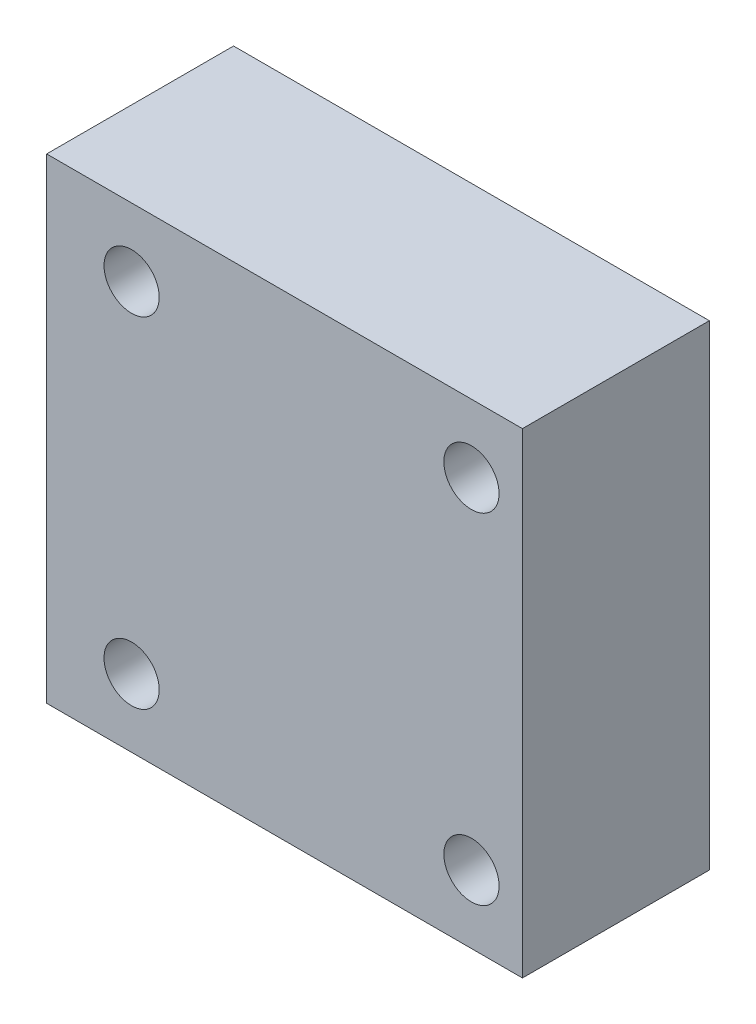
ISO-10303-21;
HEADER;
FILE_DESCRIPTION(('STEP AP214'),'2;1');
FILE_NAME('part.step','',(''),(''),'','','');
FILE_SCHEMA(('AUTOMOTIVE_DESIGN { 1 0 10303 214 1 1 1 1 }'));
ENDSEC;
DATA;
#1=APPLICATION_CONTEXT('core data for automotive mechanical design processes');
#2=APPLICATION_PROTOCOL_DEFINITION('international standard','automotive_design',2000,#1);
#3=PRODUCT_CONTEXT('',#1,'mechanical');
#4=PRODUCT('Part','Part','',(#3));
#5=PRODUCT_RELATED_PRODUCT_CATEGORY('part','',(#4));
#6=PRODUCT_DEFINITION_FORMATION('','',#4);
#7=PRODUCT_DEFINITION_CONTEXT('part definition',#1,'design');
#8=PRODUCT_DEFINITION('design','',#6,#7);
#9=PRODUCT_DEFINITION_SHAPE('','',#8);
#10=(LENGTH_UNIT() NAMED_UNIT(*) SI_UNIT(.MILLI.,.METRE.));
#11=(NAMED_UNIT(*) PLANE_ANGLE_UNIT() SI_UNIT($,.RADIAN.));
#12=(NAMED_UNIT(*) SI_UNIT($,.STERADIAN.) SOLID_ANGLE_UNIT());
#13=UNCERTAINTY_MEASURE_WITH_UNIT(LENGTH_MEASURE(1.E-05),#10,'distance_accuracy_value','');
#14=(GEOMETRIC_REPRESENTATION_CONTEXT(3) GLOBAL_UNCERTAINTY_ASSIGNED_CONTEXT((#13)) GLOBAL_UNIT_ASSIGNED_CONTEXT((#10,
#11,#12)) REPRESENTATION_CONTEXT('',''));
#15=CARTESIAN_POINT('',(0.,0.,0.));
#16=DIRECTION('',(0.,0.,1.));
#17=DIRECTION('',(1.,0.,0.));
#18=AXIS2_PLACEMENT_3D('',#15,#16,#17);
#19=CARTESIAN_POINT('',(56.,-56.,22.));
#20=DIRECTION('',(0.,0.,1.));
#21=DIRECTION('',(1.,0.,0.));
#22=AXIS2_PLACEMENT_3D('',#19,#20,#21);
#23=PLANE('',#22);
#24=CARTESIAN_POINT('',(50.,-48.,22.));
#25=DIRECTION('',(0.,0.,1.));
#26=DIRECTION('',(1.,0.,0.));
#27=AXIS2_PLACEMENT_3D('',#24,#25,#26);
#28=CIRCLE('',#27,3.25);
#29=CARTESIAN_POINT('',(53.25,-48.,22.));
#30=VERTEX_POINT('',#29);
#31=EDGE_CURVE('E120',#30,#30,#28,.T.);
#32=ORIENTED_EDGE('',*,*,#31,.F.);
#33=EDGE_LOOP('',(#32));
#34=FACE_BOUND('',#33,.T.);
#35=CARTESIAN_POINT('',(10.,-8.,22.));
#36=DIRECTION('',(0.,0.,1.));
#37=DIRECTION('',(1.,0.,0.));
#38=AXIS2_PLACEMENT_3D('',#35,#36,#37);
#39=CIRCLE('',#38,3.25);
#40=CARTESIAN_POINT('',(13.25,-8.,22.));
#41=VERTEX_POINT('',#40);
#42=EDGE_CURVE('E99',#41,#41,#39,.T.);
#43=ORIENTED_EDGE('',*,*,#42,.F.);
#44=EDGE_LOOP('',(#43));
#45=FACE_BOUND('',#44,.T.);
#46=DIRECTION('',(1.,0.,0.));
#47=VECTOR('',#46,1.);
#48=CARTESIAN_POINT('',(0.,-56.,22.));
#49=LINE('',#48,#47);
#50=CARTESIAN_POINT('',(0.,-56.,22.));
#51=VERTEX_POINT('',#50);
#52=CARTESIAN_POINT('',(56.,-56.,22.));
#53=VERTEX_POINT('',#52);
#54=EDGE_CURVE('E84',#51,#53,#49,.T.);
#55=ORIENTED_EDGE('',*,*,#54,.T.);
#56=DIRECTION('',(0.,1.,0.));
#57=VECTOR('',#56,1.);
#58=CARTESIAN_POINT('',(56.,-56.,22.));
#59=LINE('',#58,#57);
#60=CARTESIAN_POINT('',(56.,0.,22.));
#61=VERTEX_POINT('',#60);
#62=EDGE_CURVE('E79',#53,#61,#59,.T.);
#63=ORIENTED_EDGE('',*,*,#62,.T.);
#64=DIRECTION('',(-1.,0.,0.));
#65=VECTOR('',#64,1.);
#66=CARTESIAN_POINT('',(0.,0.,22.));
#67=LINE('',#66,#65);
#68=CARTESIAN_POINT('',(0.,0.,22.));
#69=VERTEX_POINT('',#68);
#70=EDGE_CURVE('E82',#61,#69,#67,.T.);
#71=ORIENTED_EDGE('',*,*,#70,.T.);
#72=DIRECTION('',(0.,-1.,0.));
#73=VECTOR('',#72,1.);
#74=CARTESIAN_POINT('',(0.,-56.,22.));
#75=LINE('',#74,#73);
#76=EDGE_CURVE('E49',#69,#51,#75,.T.);
#77=ORIENTED_EDGE('',*,*,#76,.T.);
#78=EDGE_LOOP('',(#55,#63,#71,#77));
#79=FACE_BOUND('',#78,.T.);
#80=CARTESIAN_POINT('',(50.,-8.,22.));
#81=DIRECTION('',(0.,0.,1.));
#82=DIRECTION('',(1.,0.,0.));
#83=AXIS2_PLACEMENT_3D('',#80,#81,#82);
#84=CIRCLE('',#83,3.25);
#85=CARTESIAN_POINT('',(53.25,-8.,22.));
#86=VERTEX_POINT('',#85);
#87=EDGE_CURVE('E114',#86,#86,#84,.T.);
#88=ORIENTED_EDGE('',*,*,#87,.F.);
#89=EDGE_LOOP('',(#88));
#90=FACE_BOUND('',#89,.T.);
#91=CARTESIAN_POINT('',(10.,-48.,22.));
#92=DIRECTION('',(0.,0.,1.));
#93=DIRECTION('',(1.,0.,0.));
#94=AXIS2_PLACEMENT_3D('',#91,#92,#93);
#95=CIRCLE('',#94,3.25);
#96=CARTESIAN_POINT('',(13.25,-48.,22.));
#97=VERTEX_POINT('',#96);
#98=EDGE_CURVE('E126',#97,#97,#95,.T.);
#99=ORIENTED_EDGE('',*,*,#98,.F.);
#100=EDGE_LOOP('',(#99));
#101=FACE_BOUND('',#100,.T.);
#102=ADVANCED_FACE('F32',(#34,#45,#79,#90,#101),#23,.T.);
#103=CARTESIAN_POINT('',(56.,-56.,0.));
#104=DIRECTION('',(0.,0.,1.));
#105=DIRECTION('',(1.,0.,0.));
#106=AXIS2_PLACEMENT_3D('',#103,#104,#105);
#107=PLANE('',#106);
#108=CARTESIAN_POINT('',(50.,-48.,0.));
#109=DIRECTION('',(0.,0.,1.));
#110=DIRECTION('',(1.,0.,0.));
#111=AXIS2_PLACEMENT_3D('',#108,#109,#110);
#112=CIRCLE('',#111,3.25);
#113=CARTESIAN_POINT('',(53.25,-48.,0.));
#114=VERTEX_POINT('',#113);
#115=EDGE_CURVE('E123',#114,#114,#112,.T.);
#116=ORIENTED_EDGE('',*,*,#115,.T.);
#117=EDGE_LOOP('',(#116));
#118=FACE_BOUND('',#117,.T.);
#119=CARTESIAN_POINT('',(10.,-8.,0.));
#120=DIRECTION('',(0.,0.,1.));
#121=DIRECTION('',(1.,0.,0.));
#122=AXIS2_PLACEMENT_3D('',#119,#120,#121);
#123=CIRCLE('',#122,3.25);
#124=CARTESIAN_POINT('',(13.25,-8.,0.));
#125=VERTEX_POINT('',#124);
#126=EDGE_CURVE('E111',#125,#125,#123,.T.);
#127=ORIENTED_EDGE('',*,*,#126,.T.);
#128=EDGE_LOOP('',(#127));
#129=FACE_BOUND('',#128,.T.);
#130=DIRECTION('',(1.,0.,0.));
#131=VECTOR('',#130,1.);
#132=CARTESIAN_POINT('',(0.,-56.,0.));
#133=LINE('',#132,#131);
#134=CARTESIAN_POINT('',(0.,-56.,0.));
#135=VERTEX_POINT('',#134);
#136=CARTESIAN_POINT('',(56.,-56.,0.));
#137=VERTEX_POINT('',#136);
#138=EDGE_CURVE('E96',#135,#137,#133,.T.);
#139=ORIENTED_EDGE('',*,*,#138,.F.);
#140=DIRECTION('',(0.,-1.,0.));
#141=VECTOR('',#140,1.);
#142=CARTESIAN_POINT('',(0.,-56.,0.));
#143=LINE('',#142,#141);
#144=CARTESIAN_POINT('',(0.,0.,0.));
#145=VERTEX_POINT('',#144);
#146=EDGE_CURVE('E72',#145,#135,#143,.T.);
#147=ORIENTED_EDGE('',*,*,#146,.F.);
#148=DIRECTION('',(-1.,0.,0.));
#149=VECTOR('',#148,1.);
#150=CARTESIAN_POINT('',(0.,0.,0.));
#151=LINE('',#150,#149);
#152=CARTESIAN_POINT('',(56.,0.,0.));
#153=VERTEX_POINT('',#152);
#154=EDGE_CURVE('E66',#153,#145,#151,.T.);
#155=ORIENTED_EDGE('',*,*,#154,.F.);
#156=DIRECTION('',(0.,1.,0.));
#157=VECTOR('',#156,1.);
#158=CARTESIAN_POINT('',(56.,-56.,0.));
#159=LINE('',#158,#157);
#160=EDGE_CURVE('E88',#137,#153,#159,.T.);
#161=ORIENTED_EDGE('',*,*,#160,.F.);
#162=EDGE_LOOP('',(#139,#147,#155,#161));
#163=FACE_BOUND('',#162,.T.);
#164=CARTESIAN_POINT('',(50.,-8.,0.));
#165=DIRECTION('',(0.,0.,1.));
#166=DIRECTION('',(1.,0.,0.));
#167=AXIS2_PLACEMENT_3D('',#164,#165,#166);
#168=CIRCLE('',#167,3.25);
#169=CARTESIAN_POINT('',(53.25,-8.,0.));
#170=VERTEX_POINT('',#169);
#171=EDGE_CURVE('E117',#170,#170,#168,.T.);
#172=ORIENTED_EDGE('',*,*,#171,.T.);
#173=EDGE_LOOP('',(#172));
#174=FACE_BOUND('',#173,.T.);
#175=CARTESIAN_POINT('',(10.,-48.,0.));
#176=DIRECTION('',(0.,0.,1.));
#177=DIRECTION('',(1.,0.,0.));
#178=AXIS2_PLACEMENT_3D('',#175,#176,#177);
#179=CIRCLE('',#178,3.25);
#180=CARTESIAN_POINT('',(13.25,-48.,0.));
#181=VERTEX_POINT('',#180);
#182=EDGE_CURVE('E129',#181,#181,#179,.T.);
#183=ORIENTED_EDGE('',*,*,#182,.T.);
#184=EDGE_LOOP('',(#183));
#185=FACE_BOUND('',#184,.T.);
#186=ADVANCED_FACE('F107',(#118,#129,#163,#174,#185),#107,.F.);
#187=CARTESIAN_POINT('',(0.,-56.,22.));
#188=DIRECTION('',(0.,1.,0.));
#189=DIRECTION('',(0.,0.,1.));
#190=AXIS2_PLACEMENT_3D('',#187,#188,#189);
#191=PLANE('',#190);
#192=ORIENTED_EDGE('',*,*,#138,.T.);
#193=DIRECTION('',(0.,0.,-1.));
#194=VECTOR('',#193,1.);
#195=CARTESIAN_POINT('',(56.,-56.,22.));
#196=LINE('',#195,#194);
#197=EDGE_CURVE('E11',#53,#137,#196,.T.);
#198=ORIENTED_EDGE('',*,*,#197,.F.);
#199=ORIENTED_EDGE('',*,*,#54,.F.);
#200=DIRECTION('',(0.,0.,-1.));
#201=VECTOR('',#200,1.);
#202=CARTESIAN_POINT('',(0.,-56.,22.));
#203=LINE('',#202,#201);
#204=EDGE_CURVE('E92',#51,#135,#203,.T.);
#205=ORIENTED_EDGE('',*,*,#204,.T.);
#206=EDGE_LOOP('',(#192,#198,#199,#205));
#207=FACE_BOUND('',#206,.T.);
#208=ADVANCED_FACE('F34',(#207),#191,.F.);
#209=CARTESIAN_POINT('',(56.,-56.,22.));
#210=DIRECTION('',(-1.,0.,0.));
#211=DIRECTION('',(0.,0.,1.));
#212=AXIS2_PLACEMENT_3D('',#209,#210,#211);
#213=PLANE('',#212);
#214=ORIENTED_EDGE('',*,*,#160,.T.);
#215=DIRECTION('',(0.,0.,-1.));
#216=VECTOR('',#215,1.);
#217=CARTESIAN_POINT('',(56.,0.,22.));
#218=LINE('',#217,#216);
#219=EDGE_CURVE('E41',#61,#153,#218,.T.);
#220=ORIENTED_EDGE('',*,*,#219,.F.);
#221=ORIENTED_EDGE('',*,*,#62,.F.);
#222=ORIENTED_EDGE('',*,*,#197,.T.);
#223=EDGE_LOOP('',(#214,#220,#221,#222));
#224=FACE_BOUND('',#223,.T.);
#225=ADVANCED_FACE('F87',(#224),#213,.F.);
#226=CARTESIAN_POINT('',(0.,0.,22.));
#227=DIRECTION('',(0.,-1.,0.));
#228=DIRECTION('',(0.,0.,-1.));
#229=AXIS2_PLACEMENT_3D('',#226,#227,#228);
#230=PLANE('',#229);
#231=ORIENTED_EDGE('',*,*,#154,.T.);
#232=DIRECTION('',(0.,0.,-1.));
#233=VECTOR('',#232,1.);
#234=CARTESIAN_POINT('',(0.,0.,22.));
#235=LINE('',#234,#233);
#236=EDGE_CURVE('E89',#69,#145,#235,.T.);
#237=ORIENTED_EDGE('',*,*,#236,.F.);
#238=ORIENTED_EDGE('',*,*,#70,.F.);
#239=ORIENTED_EDGE('',*,*,#219,.T.);
#240=EDGE_LOOP('',(#231,#237,#238,#239));
#241=FACE_BOUND('',#240,.T.);
#242=ADVANCED_FACE('F90',(#241),#230,.F.);
#243=CARTESIAN_POINT('',(0.,-56.,22.));
#244=DIRECTION('',(1.,0.,0.));
#245=DIRECTION('',(0.,0.,-1.));
#246=AXIS2_PLACEMENT_3D('',#243,#244,#245);
#247=PLANE('',#246);
#248=ORIENTED_EDGE('',*,*,#146,.T.);
#249=ORIENTED_EDGE('',*,*,#204,.F.);
#250=ORIENTED_EDGE('',*,*,#76,.F.);
#251=ORIENTED_EDGE('',*,*,#236,.T.);
#252=EDGE_LOOP('',(#248,#249,#250,#251));
#253=FACE_BOUND('',#252,.T.);
#254=ADVANCED_FACE('F104',(#253),#247,.F.);
#255=CARTESIAN_POINT('',(10.,-8.,22.));
#256=DIRECTION('',(0.,0.,-1.));
#257=DIRECTION('',(-1.,0.,0.));
#258=AXIS2_PLACEMENT_3D('',#255,#256,#257);
#259=CYLINDRICAL_SURFACE('',#258,3.25);
#260=ORIENTED_EDGE('',*,*,#42,.T.);
#261=EDGE_LOOP('',(#260));
#262=FACE_BOUND('',#261,.T.);
#263=ORIENTED_EDGE('',*,*,#126,.F.);
#264=EDGE_LOOP('',(#263));
#265=FACE_BOUND('',#264,.T.);
#266=ADVANCED_FACE('F149',(#262,#265),#259,.F.);
#267=CARTESIAN_POINT('',(50.,-8.,22.));
#268=DIRECTION('',(0.,0.,-1.));
#269=DIRECTION('',(-1.,0.,0.));
#270=AXIS2_PLACEMENT_3D('',#267,#268,#269);
#271=CYLINDRICAL_SURFACE('',#270,3.25);
#272=ORIENTED_EDGE('',*,*,#87,.T.);
#273=EDGE_LOOP('',(#272));
#274=FACE_BOUND('',#273,.T.);
#275=ORIENTED_EDGE('',*,*,#171,.F.);
#276=EDGE_LOOP('',(#275));
#277=FACE_BOUND('',#276,.T.);
#278=ADVANCED_FACE('F195',(#274,#277),#271,.F.);
#279=CARTESIAN_POINT('',(50.,-48.,22.));
#280=DIRECTION('',(0.,0.,-1.));
#281=DIRECTION('',(-1.,0.,0.));
#282=AXIS2_PLACEMENT_3D('',#279,#280,#281);
#283=CYLINDRICAL_SURFACE('',#282,3.25);
#284=ORIENTED_EDGE('',*,*,#31,.T.);
#285=EDGE_LOOP('',(#284));
#286=FACE_BOUND('',#285,.T.);
#287=ORIENTED_EDGE('',*,*,#115,.F.);
#288=EDGE_LOOP('',(#287));
#289=FACE_BOUND('',#288,.T.);
#290=ADVANCED_FACE('F203',(#286,#289),#283,.F.);
#291=CARTESIAN_POINT('',(10.,-48.,22.));
#292=DIRECTION('',(0.,0.,-1.));
#293=DIRECTION('',(-1.,0.,0.));
#294=AXIS2_PLACEMENT_3D('',#291,#292,#293);
#295=CYLINDRICAL_SURFACE('',#294,3.25);
#296=ORIENTED_EDGE('',*,*,#98,.T.);
#297=EDGE_LOOP('',(#296));
#298=FACE_BOUND('',#297,.T.);
#299=ORIENTED_EDGE('',*,*,#182,.F.);
#300=EDGE_LOOP('',(#299));
#301=FACE_BOUND('',#300,.T.);
#302=ADVANCED_FACE('F135',(#298,#301),#295,.F.);
#303=CLOSED_SHELL('',(#102,#186,#208,#225,#242,#254,#266,#278,#290,#302));
#304=MANIFOLD_SOLID_BREP('B2',#303);
#305=ADVANCED_BREP_SHAPE_REPRESENTATION('',(#18,#304),#14);
#306=SHAPE_DEFINITION_REPRESENTATION(#9,#305);
ENDSEC;
END-ISO-10303-21;
